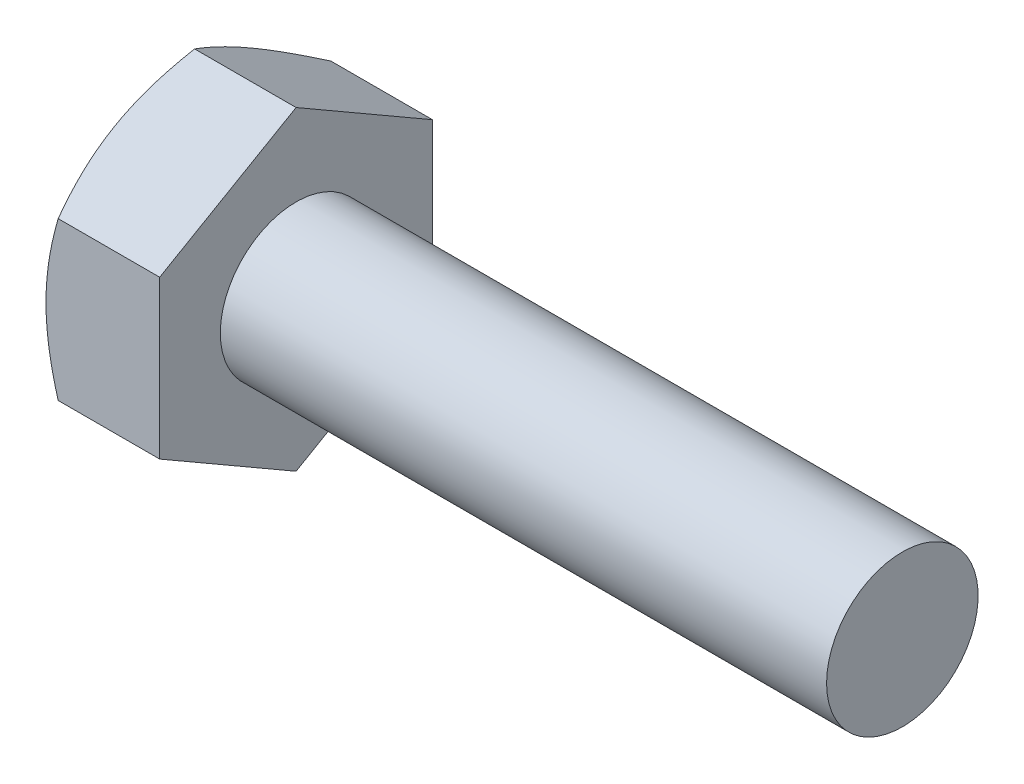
ISO-10303-21;
HEADER;
FILE_DESCRIPTION(('STEP AP214'),'2;1');
FILE_NAME('part.step','',(''),(''),'','','');
FILE_SCHEMA(('AUTOMOTIVE_DESIGN { 1 0 10303 214 1 1 1 1 }'));
ENDSEC;
DATA;
#1=APPLICATION_CONTEXT('core data for automotive mechanical design processes');
#2=APPLICATION_PROTOCOL_DEFINITION('international standard','automotive_design',2000,#1);
#3=PRODUCT_CONTEXT('',#1,'mechanical');
#4=PRODUCT('Part','Part','',(#3));
#5=PRODUCT_RELATED_PRODUCT_CATEGORY('part','',(#4));
#6=PRODUCT_DEFINITION_FORMATION('','',#4);
#7=PRODUCT_DEFINITION_CONTEXT('part definition',#1,'design');
#8=PRODUCT_DEFINITION('design','',#6,#7);
#9=PRODUCT_DEFINITION_SHAPE('','',#8);
#10=(LENGTH_UNIT() NAMED_UNIT(*) SI_UNIT(.MILLI.,.METRE.));
#11=(NAMED_UNIT(*) PLANE_ANGLE_UNIT() SI_UNIT($,.RADIAN.));
#12=(NAMED_UNIT(*) SI_UNIT($,.STERADIAN.) SOLID_ANGLE_UNIT());
#13=UNCERTAINTY_MEASURE_WITH_UNIT(LENGTH_MEASURE(1.E-05),#10,'distance_accuracy_value','');
#14=(GEOMETRIC_REPRESENTATION_CONTEXT(3) GLOBAL_UNCERTAINTY_ASSIGNED_CONTEXT((#13)) GLOBAL_UNIT_ASSIGNED_CONTEXT((#10,
#11,#12)) REPRESENTATION_CONTEXT('',''));
#15=CARTESIAN_POINT('',(0.,0.,0.));
#16=DIRECTION('',(0.,0.,1.));
#17=DIRECTION('',(1.,0.,0.));
#18=AXIS2_PLACEMENT_3D('',#15,#16,#17);
#19=CARTESIAN_POINT('',(0.,0.,0.));
#20=DIRECTION('',(-1.,0.,0.));
#21=DIRECTION('',(0.,0.,1.));
#22=AXIS2_PLACEMENT_3D('',#19,#20,#21);
#23=PLANE('',#22);
#24=CARTESIAN_POINT('',(0.,0.,0.));
#25=DIRECTION('',(-1.,0.,0.));
#26=DIRECTION('',(0.,0.,1.));
#27=AXIS2_PLACEMENT_3D('',#24,#25,#26);
#28=CIRCLE('',#27,9.);
#29=CARTESIAN_POINT('',(0.,0.,9.));
#30=VERTEX_POINT('',#29);
#31=CARTESIAN_POINT('',(0.,7.79422865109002,4.50000002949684));
#32=VERTEX_POINT('',#31);
#33=EDGE_CURVE('E40',#30,#32,#28,.T.);
#34=ORIENTED_EDGE('',*,*,#33,.T.);
#35=CARTESIAN_POINT('',(0.,7.79422865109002,-4.50000002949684));
#36=VERTEX_POINT('',#35);
#37=EDGE_CURVE('E200',#32,#36,#28,.T.);
#38=ORIENTED_EDGE('',*,*,#37,.T.);
#39=CARTESIAN_POINT('',(0.,0.,-9.));
#40=VERTEX_POINT('',#39);
#41=EDGE_CURVE('E205',#36,#40,#28,.T.);
#42=ORIENTED_EDGE('',*,*,#41,.T.);
#43=CARTESIAN_POINT('',(0.,-7.79422865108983,-4.50000002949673));
#44=VERTEX_POINT('',#43);
#45=EDGE_CURVE('E209',#40,#44,#28,.T.);
#46=ORIENTED_EDGE('',*,*,#45,.T.);
#47=CARTESIAN_POINT('',(0.,-7.79422865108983,4.50000002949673));
#48=VERTEX_POINT('',#47);
#49=EDGE_CURVE('E206',#44,#48,#28,.T.);
#50=ORIENTED_EDGE('',*,*,#49,.T.);
#51=EDGE_CURVE('E198',#48,#30,#28,.T.);
#52=ORIENTED_EDGE('',*,*,#51,.T.);
#53=EDGE_LOOP('',(#34,#38,#42,#46,#50,#52));
#54=FACE_BOUND('',#53,.T.);
#55=CARTESIAN_POINT('',(0.,0.,0.));
#56=DIRECTION('',(1.,0.,0.));
#57=DIRECTION('',(0.,0.,-1.));
#58=AXIS2_PLACEMENT_3D('',#55,#56,#57);
#59=CIRCLE('',#58,7.875);
#60=CARTESIAN_POINT('',(0.,0.,-7.875));
#61=VERTEX_POINT('',#60);
#62=EDGE_CURVE('E237',#61,#61,#59,.T.);
#63=ORIENTED_EDGE('',*,*,#62,.T.);
#64=EDGE_LOOP('',(#63));
#65=FACE_BOUND('',#64,.T.);
#66=ADVANCED_FACE('F32',(#54,#65),#23,.T.);
#67=CARTESIAN_POINT('',(7.5,5.,0.));
#68=DIRECTION('',(-1.,0.,0.));
#69=DIRECTION('',(0.,0.,1.));
#70=AXIS2_PLACEMENT_3D('',#67,#68,#69);
#71=PLANE('',#70);
#72=CARTESIAN_POINT('',(7.5,0.,0.));
#73=DIRECTION('',(-1.,0.,0.));
#74=DIRECTION('',(0.,0.,1.));
#75=AXIS2_PLACEMENT_3D('',#72,#73,#74);
#76=CIRCLE('',#75,5.);
#77=CARTESIAN_POINT('',(7.5,0.,5.));
#78=VERTEX_POINT('',#77);
#79=EDGE_CURVE('E196',#78,#78,#76,.T.);
#80=ORIENTED_EDGE('',*,*,#79,.T.);
#81=EDGE_LOOP('',(#80));
#82=FACE_BOUND('',#81,.T.);
#83=DIRECTION('',(0.,1.,0.));
#84=VECTOR('',#83,1.);
#85=CARTESIAN_POINT('',(7.5,-5.19615244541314,9.));
#86=LINE('',#85,#84);
#87=CARTESIAN_POINT('',(7.5,-5.19615244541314,9.));
#88=VERTEX_POINT('',#87);
#89=CARTESIAN_POINT('',(7.5,5.19615244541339,9.));
#90=VERTEX_POINT('',#89);
#91=EDGE_CURVE('E55',#88,#90,#86,.T.);
#92=ORIENTED_EDGE('',*,*,#91,.F.);
#93=DIRECTION('',(0.,0.50000000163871,0.866025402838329));
#94=VECTOR('',#93,1.);
#95=CARTESIAN_POINT('',(7.5,-10.3923048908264,0.));
#96=LINE('',#95,#94);
#97=CARTESIAN_POINT('',(7.5,-10.3923048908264,0.));
#98=VERTEX_POINT('',#97);
#99=EDGE_CURVE('E129',#98,#88,#96,.T.);
#100=ORIENTED_EDGE('',*,*,#99,.F.);
#101=DIRECTION('',(0.,-0.50000000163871,0.866025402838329));
#102=VECTOR('',#101,1.);
#103=CARTESIAN_POINT('',(7.5,-5.19615244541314,-9.));
#104=LINE('',#103,#102);
#105=CARTESIAN_POINT('',(7.5,-5.19615244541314,-9.));
#106=VERTEX_POINT('',#105);
#107=EDGE_CURVE('E127',#106,#98,#104,.T.);
#108=ORIENTED_EDGE('',*,*,#107,.F.);
#109=DIRECTION('',(0.,-1.,0.));
#110=VECTOR('',#109,1.);
#111=CARTESIAN_POINT('',(7.5,5.19615244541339,-9.));
#112=LINE('',#111,#110);
#113=CARTESIAN_POINT('',(7.5,5.19615244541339,-9.));
#114=VERTEX_POINT('',#113);
#115=EDGE_CURVE('E109',#114,#106,#112,.T.);
#116=ORIENTED_EDGE('',*,*,#115,.F.);
#117=DIRECTION('',(0.,-0.50000000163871,-0.866025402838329));
#118=VECTOR('',#117,1.);
#119=CARTESIAN_POINT('',(7.5,10.3923048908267,0.));
#120=LINE('',#119,#118);
#121=CARTESIAN_POINT('',(7.5,10.3923048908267,0.));
#122=VERTEX_POINT('',#121);
#123=EDGE_CURVE('E118',#122,#114,#120,.T.);
#124=ORIENTED_EDGE('',*,*,#123,.F.);
#125=DIRECTION('',(0.,0.50000000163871,-0.866025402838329));
#126=VECTOR('',#125,1.);
#127=CARTESIAN_POINT('',(7.5,5.19615244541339,9.));
#128=LINE('',#127,#126);
#129=EDGE_CURVE('E122',#90,#122,#128,.T.);
#130=ORIENTED_EDGE('',*,*,#129,.F.);
#131=EDGE_LOOP('',(#92,#100,#108,#116,#124,#130));
#132=FACE_BOUND('',#131,.T.);
#133=ADVANCED_FACE('F124',(#82,#132),#71,.F.);
#134=CARTESIAN_POINT('',(-25.4,0.,0.));
#135=DIRECTION('',(-1.,0.,0.));
#136=DIRECTION('',(0.,0.,1.));
#137=AXIS2_PLACEMENT_3D('',#134,#135,#136);
#138=CYLINDRICAL_SURFACE('',#137,5.);
#139=CARTESIAN_POINT('',(47.5,0.,0.));
#140=DIRECTION('',(-1.,0.,0.));
#141=DIRECTION('',(0.,0.,1.));
#142=AXIS2_PLACEMENT_3D('',#139,#140,#141);
#143=CIRCLE('',#142,5.);
#144=CARTESIAN_POINT('',(47.5,0.,5.));
#145=VERTEX_POINT('',#144);
#146=EDGE_CURVE('E11',#145,#145,#143,.T.);
#147=ORIENTED_EDGE('',*,*,#146,.T.);
#148=EDGE_LOOP('',(#147));
#149=FACE_BOUND('',#148,.T.);
#150=ORIENTED_EDGE('',*,*,#79,.F.);
#151=EDGE_LOOP('',(#150));
#152=FACE_BOUND('',#151,.T.);
#153=ADVANCED_FACE('F34',(#149,#152),#138,.T.);
#154=CARTESIAN_POINT('',(47.5,5.,0.));
#155=DIRECTION('',(1.,0.,0.));
#156=DIRECTION('',(0.,0.,-1.));
#157=AXIS2_PLACEMENT_3D('',#154,#155,#156);
#158=PLANE('',#157);
#159=ORIENTED_EDGE('',*,*,#146,.F.);
#160=EDGE_LOOP('',(#159));
#161=FACE_BOUND('',#160,.T.);
#162=ADVANCED_FACE('F177',(#161),#158,.T.);
#163=CARTESIAN_POINT('',(7.5,-5.19615244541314,9.));
#164=DIRECTION('',(0.,0.,1.));
#165=DIRECTION('',(0.,-1.,0.));
#166=AXIS2_PLACEMENT_3D('',#163,#164,#165);
#167=PLANE('',#166);
#168=DIRECTION('',(-1.,0.,0.));
#169=VECTOR('',#168,1.);
#170=CARTESIAN_POINT('',(7.5,-5.19615244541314,9.));
#171=LINE('',#170,#169);
#172=CARTESIAN_POINT('',(0.803847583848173,-5.19615244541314,9.));
#173=VERTEX_POINT('',#172);
#174=EDGE_CURVE('E136',#88,#173,#171,.T.);
#175=ORIENTED_EDGE('',*,*,#174,.F.);
#176=ORIENTED_EDGE('',*,*,#91,.T.);
#177=DIRECTION('',(-1.,0.,0.));
#178=VECTOR('',#177,1.);
#179=CARTESIAN_POINT('',(7.5,5.19615244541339,9.));
#180=LINE('',#179,#178);
#181=CARTESIAN_POINT('',(0.803847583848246,5.19615244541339,9.));
#182=VERTEX_POINT('',#181);
#183=EDGE_CURVE('E135',#90,#182,#180,.T.);
#184=ORIENTED_EDGE('',*,*,#183,.T.);
#185=CARTESIAN_POINT('',(4.30675215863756,-13.7809864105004,9.00000000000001));
#186=CARTESIAN_POINT('',(4.21125056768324,-13.5834182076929,9.00000000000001));
#187=CARTESIAN_POINT('',(4.11624323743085,-13.3856112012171,9.00000000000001));
#188=CARTESIAN_POINT('',(3.92733055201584,-12.9894691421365,9.00000000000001));
#189=CARTESIAN_POINT('',(3.83342520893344,-12.7911340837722,9.00000000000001));
#190=CARTESIAN_POINT('',(3.55350512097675,-12.1952030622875,9.00000000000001));
#191=CARTESIAN_POINT('',(3.36931745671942,-11.7967454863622,9.00000000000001));
#192=CARTESIAN_POINT('',(3.00594950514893,-10.9947966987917,9.00000000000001));
#193=CARTESIAN_POINT('',(2.82680390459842,-10.5912897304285,9.));
#194=CARTESIAN_POINT('',(2.47620436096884,-9.78096004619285,9.));
#195=CARTESIAN_POINT('',(2.30475001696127,-9.37413750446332,9.));
#196=CARTESIAN_POINT('',(1.96954751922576,-8.55147796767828,9.));
#197=CARTESIAN_POINT('',(1.80591981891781,-8.13559162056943,9.));
#198=CARTESIAN_POINT('',(1.49147930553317,-7.2989146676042,9.));
#199=CARTESIAN_POINT('',(1.34066791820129,-6.87812352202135,9.));
#200=CARTESIAN_POINT('',(1.05591315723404,-6.03182651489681,9.));
#201=CARTESIAN_POINT('',(0.921933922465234,-5.6063328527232,9.));
#202=CARTESIAN_POINT('',(0.675192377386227,-4.74931186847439,9.));
#203=CARTESIAN_POINT('',(0.562423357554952,-4.31778650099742,9.));
#204=CARTESIAN_POINT('',(0.363585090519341,-3.44833526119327,9.));
#205=CARTESIAN_POINT('',(0.27752295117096,-3.0104077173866,9.));
#206=CARTESIAN_POINT('',(0.172769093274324,-2.34966278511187,9.));
#207=CARTESIAN_POINT('',(0.141905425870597,-2.12874509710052,9.));
#208=CARTESIAN_POINT('',(0.0888984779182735,-1.68587395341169,9.));
#209=CARTESIAN_POINT('',(0.0667543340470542,-1.46392060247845,9.));
#210=CARTESIAN_POINT('',(0.0317823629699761,-1.02068615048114,9.));
#211=CARTESIAN_POINT('',(0.0188966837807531,-0.799409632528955,9.));
#212=CARTESIAN_POINT('',(0.00250976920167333,-0.356509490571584,9.));
#213=CARTESIAN_POINT('',(-0.000991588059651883,-0.1348858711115,9.));
#214=CARTESIAN_POINT('',(0.00147357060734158,0.308247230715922,9.));
#215=CARTESIAN_POINT('',(0.00743742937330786,0.529756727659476,9.));
#216=CARTESIAN_POINT('',(0.0286847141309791,0.972331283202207,9.));
#217=CARTESIAN_POINT('',(0.0439686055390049,1.19339631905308,9.));
#218=CARTESIAN_POINT('',(0.0919878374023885,1.72918911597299,9.));
#219=CARTESIAN_POINT('',(0.129392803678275,2.0435052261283,9.));
#220=CARTESIAN_POINT('',(0.220967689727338,2.66972888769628,9.));
#221=CARTESIAN_POINT('',(0.275142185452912,2.98163575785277,9.));
#222=CARTESIAN_POINT('',(0.398334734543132,3.60278361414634,9.));
#223=CARTESIAN_POINT('',(0.46736682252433,3.91202179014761,9.));
#224=CARTESIAN_POINT('',(0.61816830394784,4.52731652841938,9.));
#225=CARTESIAN_POINT('',(0.69993649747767,4.83337338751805,9.));
#226=CARTESIAN_POINT('',(0.876391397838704,5.44984363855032,9.));
#227=CARTESIAN_POINT('',(0.971345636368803,5.76017992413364,9.));
#228=CARTESIAN_POINT('',(1.17063619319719,6.37757223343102,9.));
#229=CARTESIAN_POINT('',(1.27496604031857,6.68463035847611,9.));
#230=CARTESIAN_POINT('',(1.49085277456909,7.29423423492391,9.));
#231=CARTESIAN_POINT('',(1.60236567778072,7.59679565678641,9.));
#232=CARTESIAN_POINT('',(1.8319366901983,8.1995710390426,9.));
#233=CARTESIAN_POINT('',(1.9499974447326,8.49978399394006,9.));
#234=CARTESIAN_POINT('',(2.07068439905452,8.79890630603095,9.));
#235=B_SPLINE_CURVE_WITH_KNOTS('',3,(#185,#186,#187,#188,#189,#190,#191,#192,#193,#194,#195,
#196,#197,#198,#199,#200,#201,#202,#203,#204,#205,#206,#207,#208,#209,#210,#211,#212,#213,#214,
#215,#216,#217,#218,#219,#220,#221,#222,#223,#224,#225,#226,#227,#228,#229,#230,#231,#232,#233,
#234),.UNSPECIFIED.,.F.,.F.,(4,2,2,2,2,2,2,2,2,2,2,2,2,2,2,2,2,2,2,2,2,2,2,2,4),(0.,
0.658317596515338,1.31664240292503,2.63350615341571,3.95790574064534,5.28223620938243,
6.62282571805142,7.96356416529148,9.3013958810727,10.6388036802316,11.9765671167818,
12.6456116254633,13.3145898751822,13.9793507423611,14.6441029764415,15.3086686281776,
15.9732674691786,16.9223404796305,17.8716726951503,18.8219056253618,19.772049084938,
20.7454827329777,21.7182495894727,22.6855410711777,23.6532262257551),.UNSPECIFIED.);
#236=EDGE_CURVE('E179',#30,#182,#235,.T.);
#237=ORIENTED_EDGE('',*,*,#236,.F.);
#238=EDGE_CURVE('E187',#173,#30,#235,.T.);
#239=ORIENTED_EDGE('',*,*,#238,.F.);
#240=EDGE_LOOP('',(#175,#176,#184,#237,#239));
#241=FACE_BOUND('',#240,.T.);
#242=ADVANCED_FACE('F173',(#241),#167,.T.);
#243=CARTESIAN_POINT('',(7.5,-10.3923048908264,0.));
#244=DIRECTION('',(0.,-0.866025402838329,0.50000000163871));
#245=DIRECTION('',(0.,-0.50000000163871,-0.866025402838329));
#246=AXIS2_PLACEMENT_3D('',#243,#244,#245);
#247=PLANE('',#246);
#248=DIRECTION('',(-1.,0.,0.));
#249=VECTOR('',#248,1.);
#250=CARTESIAN_POINT('',(7.5,-10.3923048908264,0.));
#251=LINE('',#250,#249);
#252=CARTESIAN_POINT('',(0.803847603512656,-10.3923048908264,0.));
#253=VERTEX_POINT('',#252);
#254=EDGE_CURVE('E140',#98,#253,#251,.T.);
#255=ORIENTED_EDGE('',*,*,#254,.F.);
#256=ORIENTED_EDGE('',*,*,#99,.T.);
#257=ORIENTED_EDGE('',*,*,#174,.T.);
#258=CARTESIAN_POINT('',(0.803914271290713,-10.3924203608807,-0.000200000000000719));
#259=CARTESIAN_POINT('',(0.737982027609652,-10.2782164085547,0.197607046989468));
#260=CARTESIAN_POINT('',(0.675041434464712,-10.1635670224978,0.396185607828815));
#261=CARTESIAN_POINT('',(0.555969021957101,-9.93333719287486,0.794955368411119));
#262=CARTESIAN_POINT('',(0.499840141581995,-9.81775637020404,0.995147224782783));
#263=CARTESIAN_POINT('',(0.395151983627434,-9.58544919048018,1.39751506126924));
#264=CARTESIAN_POINT('',(0.346610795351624,-9.46872078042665,1.59969459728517));
#265=CARTESIAN_POINT('',(0.258148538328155,-9.23447005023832,2.00542876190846));
#266=CARTESIAN_POINT('',(0.218225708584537,-9.11694789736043,2.20898310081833));
#267=CARTESIAN_POINT('',(0.148684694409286,-8.88408936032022,2.61230591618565));
#268=CARTESIAN_POINT('',(0.118837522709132,-8.76877017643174,2.81204460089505));
#269=CARTESIAN_POINT('',(0.0687933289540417,-8.53761582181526,3.21241568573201));
#270=CARTESIAN_POINT('',(0.04859545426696,-8.42178069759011,3.41304800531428));
#271=CARTESIAN_POINT('',(0.0183543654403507,-8.18990952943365,3.8146606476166));
#272=CARTESIAN_POINT('',(0.00829962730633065,-8.07387386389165,4.01564031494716));
#273=CARTESIAN_POINT('',(-0.0014376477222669,-7.84169574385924,4.41778461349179));
#274=CARTESIAN_POINT('',(-0.0011205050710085,-7.725553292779,4.61894923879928));
#275=CARTESIAN_POINT('',(0.00916396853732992,-7.50842144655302,4.99503262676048));
#276=CARTESIAN_POINT('',(0.0178767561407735,-7.40741674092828,5.16997790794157));
#277=CARTESIAN_POINT('',(0.0429773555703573,-7.2056439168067,5.5194586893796));
#278=CARTESIAN_POINT('',(0.0593656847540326,-7.10487581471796,5.69399416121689));
#279=CARTESIAN_POINT('',(0.119656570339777,-6.80296161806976,6.21692488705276));
#280=CARTESIAN_POINT('',(0.17467749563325,-6.60234992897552,6.56439452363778));
#281=CARTESIAN_POINT('',(0.312230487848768,-6.19899853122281,7.26301963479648));
#282=CARTESIAN_POINT('',(0.39534562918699,-5.99631029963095,7.61408594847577));
#283=CARTESIAN_POINT('',(0.583982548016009,-5.59395642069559,8.31098330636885));
#284=CARTESIAN_POINT('',(0.689460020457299,-5.39428562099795,8.65682327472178));
#285=CARTESIAN_POINT('',(0.803914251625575,-5.19603697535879,9.0002));
#286=B_SPLINE_CURVE_WITH_KNOTS('',3,(#258,#259,#260,#261,#262,#263,#264,#265,#266,#267,#268,
#269,#270,#271,#272,#273,#274,#275,#276,#277,#278,#279,#280,#281,#282,#283,#284,#285),
.UNSPECIFIED.,.F.,.F.,(4,2,2,2,2,2,2,2,2,2,2,2,2,4),(0.,0.713219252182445,1.42674514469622,
2.14194698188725,2.8570025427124,3.55449750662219,4.25193082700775,4.94857087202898,
5.6451893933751,6.25162978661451,6.85811106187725,8.07193749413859,9.3126839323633,
10.5509947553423),.UNSPECIFIED.);
#287=EDGE_CURVE('E189',#48,#173,#286,.T.);
#288=ORIENTED_EDGE('',*,*,#287,.F.);
#289=EDGE_CURVE('E188',#253,#48,#286,.T.);
#290=ORIENTED_EDGE('',*,*,#289,.F.);
#291=EDGE_LOOP('',(#255,#256,#257,#288,#290));
#292=FACE_BOUND('',#291,.T.);
#293=ADVANCED_FACE('F176',(#292),#247,.T.);
#294=CARTESIAN_POINT('',(7.5,-5.19615244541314,-9.));
#295=DIRECTION('',(0.,-0.866025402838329,-0.50000000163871));
#296=DIRECTION('',(0.,0.50000000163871,-0.866025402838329));
#297=AXIS2_PLACEMENT_3D('',#294,#295,#296);
#298=PLANE('',#297);
#299=DIRECTION('',(-1.,0.,0.));
#300=VECTOR('',#299,1.);
#301=CARTESIAN_POINT('',(7.5,-5.19615244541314,-9.));
#302=LINE('',#301,#300);
#303=CARTESIAN_POINT('',(0.803847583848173,-5.19615244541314,-9.));
#304=VERTEX_POINT('',#303);
#305=EDGE_CURVE('E115',#106,#304,#302,.T.);
#306=ORIENTED_EDGE('',*,*,#305,.F.);
#307=ORIENTED_EDGE('',*,*,#107,.T.);
#308=ORIENTED_EDGE('',*,*,#254,.T.);
#309=CARTESIAN_POINT('',(0.803914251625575,-5.19603697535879,-9.0002));
#310=CARTESIAN_POINT('',(0.737982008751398,-5.31024092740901,-8.80239295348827));
#311=CARTESIAN_POINT('',(0.675041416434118,-5.42489031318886,-8.60381439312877));
#312=CARTESIAN_POINT('',(0.555969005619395,-5.65512014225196,-8.20504463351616));
#313=CARTESIAN_POINT('',(0.499840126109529,-5.77070096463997,-8.00485277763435));
#314=CARTESIAN_POINT('',(0.395151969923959,-6.00300814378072,-7.60248494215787));
#315=CARTESIAN_POINT('',(0.346610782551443,-6.11973655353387,-7.40030540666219));
#316=CARTESIAN_POINT('',(0.258148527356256,-6.35398728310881,-6.99457124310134));
#317=CARTESIAN_POINT('',(0.218225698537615,-6.47150943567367,-6.79101690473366));
#318=CARTESIAN_POINT('',(0.148684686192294,-6.70436797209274,-6.38769409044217));
#319=CARTESIAN_POINT('',(0.118837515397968,-6.81968715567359,-6.18795540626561));
#320=CARTESIAN_POINT('',(0.0687933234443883,-7.05084150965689,-5.78758432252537));
#321=CARTESIAN_POINT('',(0.0485954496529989,-7.16667663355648,-5.58695200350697));
#322=CARTESIAN_POINT('',(0.0183543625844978,-7.39854780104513,-5.18533936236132));
#323=CARTESIAN_POINT('',(0.00829962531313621,-7.51458346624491,-4.98435969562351));
#324=CARTESIAN_POINT('',(-0.0014376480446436,-7.74676158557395,-4.58221539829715));
#325=CARTESIAN_POINT('',(-0.00112050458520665,-7.86290403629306,-4.38105077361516));
#326=CARTESIAN_POINT('',(0.00916397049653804,-8.08003588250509,-4.00496738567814));
#327=CARTESIAN_POINT('',(0.0178767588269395,-8.18104058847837,-3.83002210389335));
#328=CARTESIAN_POINT('',(0.0429773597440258,-8.38281341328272,-3.48054132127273));
#329=CARTESIAN_POINT('',(0.0593656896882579,-8.48358151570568,-3.30600584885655));
#330=CARTESIAN_POINT('',(0.119656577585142,-8.78549571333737,-2.78307512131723));
#331=CARTESIAN_POINT('',(0.174677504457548,-8.98610740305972,-2.43560548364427));
#332=CARTESIAN_POINT('',(0.312230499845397,-9.3894588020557,-1.73698037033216));
#333=CARTESIAN_POINT('',(0.395345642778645,-9.59214703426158,-1.38591405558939));
#334=CARTESIAN_POINT('',(0.583982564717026,-9.99450091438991,-0.689016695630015));
#335=CARTESIAN_POINT('',(0.689460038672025,-10.1941717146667,-0.343176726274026));
#336=CARTESIAN_POINT('',(0.803914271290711,-10.3924203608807,0.000199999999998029));
#337=B_SPLINE_CURVE_WITH_KNOTS('',3,(#309,#310,#311,#312,#313,#314,#315,#316,#317,#318,#319,
#320,#321,#322,#323,#324,#325,#326,#327,#328,#329,#330,#331,#332,#333,#334,#335,#336),
.UNSPECIFIED.,.F.,.F.,(4,2,2,2,2,2,2,2,2,2,2,2,2,4),(0.,0.713219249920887,1.42674514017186,
2.14194697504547,2.85700253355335,3.55449749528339,4.25193081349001,4.94857085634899,
5.64518937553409,6.25162977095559,6.85811104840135,8.07193748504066,9.31268392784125,
10.5509947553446),.UNSPECIFIED.);
#338=EDGE_CURVE('E219',#44,#253,#337,.T.);
#339=ORIENTED_EDGE('',*,*,#338,.F.);
#340=EDGE_CURVE('E224',#304,#44,#337,.T.);
#341=ORIENTED_EDGE('',*,*,#340,.F.);
#342=EDGE_LOOP('',(#306,#307,#308,#339,#341));
#343=FACE_BOUND('',#342,.T.);
#344=ADVANCED_FACE('F296',(#343),#298,.T.);
#345=CARTESIAN_POINT('',(7.5,5.19615244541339,-9.));
#346=DIRECTION('',(0.,0.,-1.));
#347=DIRECTION('',(0.,1.,0.));
#348=AXIS2_PLACEMENT_3D('',#345,#346,#347);
#349=PLANE('',#348);
#350=DIRECTION('',(-1.,0.,0.));
#351=VECTOR('',#350,1.);
#352=CARTESIAN_POINT('',(7.5,5.19615244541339,-9.));
#353=LINE('',#352,#351);
#354=CARTESIAN_POINT('',(0.803847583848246,5.19615244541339,-9.));
#355=VERTEX_POINT('',#354);
#356=EDGE_CURVE('E104',#114,#355,#353,.T.);
#357=ORIENTED_EDGE('',*,*,#356,.F.);
#358=ORIENTED_EDGE('',*,*,#115,.T.);
#359=ORIENTED_EDGE('',*,*,#305,.T.);
#360=CARTESIAN_POINT('',(4.30675215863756,-13.7809864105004,-9.00000000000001));
#361=CARTESIAN_POINT('',(4.21125056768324,-13.5834182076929,-9.00000000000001));
#362=CARTESIAN_POINT('',(4.11624323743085,-13.3856112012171,-9.00000000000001));
#363=CARTESIAN_POINT('',(3.92733055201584,-12.9894691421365,-9.00000000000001));
#364=CARTESIAN_POINT('',(3.83342520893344,-12.7911340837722,-9.00000000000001));
#365=CARTESIAN_POINT('',(3.55350512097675,-12.1952030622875,-9.00000000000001));
#366=CARTESIAN_POINT('',(3.36931745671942,-11.7967454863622,-9.00000000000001));
#367=CARTESIAN_POINT('',(3.00594950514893,-10.9947966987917,-9.00000000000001));
#368=CARTESIAN_POINT('',(2.82680390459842,-10.5912897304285,-9.));
#369=CARTESIAN_POINT('',(2.47620436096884,-9.78096004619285,-9.));
#370=CARTESIAN_POINT('',(2.30475001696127,-9.37413750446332,-9.));
#371=CARTESIAN_POINT('',(1.96954751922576,-8.55147796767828,-9.));
#372=CARTESIAN_POINT('',(1.80591981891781,-8.13559162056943,-9.));
#373=CARTESIAN_POINT('',(1.49147930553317,-7.2989146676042,-9.));
#374=CARTESIAN_POINT('',(1.34066791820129,-6.87812352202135,-9.));
#375=CARTESIAN_POINT('',(1.05591315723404,-6.03182651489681,-9.));
#376=CARTESIAN_POINT('',(0.921933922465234,-5.6063328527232,-9.));
#377=CARTESIAN_POINT('',(0.675192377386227,-4.74931186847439,-9.));
#378=CARTESIAN_POINT('',(0.562423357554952,-4.31778650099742,-9.));
#379=CARTESIAN_POINT('',(0.363585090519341,-3.44833526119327,-9.));
#380=CARTESIAN_POINT('',(0.27752295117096,-3.0104077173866,-9.));
#381=CARTESIAN_POINT('',(0.172769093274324,-2.34966278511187,-9.));
#382=CARTESIAN_POINT('',(0.141905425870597,-2.12874509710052,-9.));
#383=CARTESIAN_POINT('',(0.0888984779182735,-1.68587395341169,-9.));
#384=CARTESIAN_POINT('',(0.0667543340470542,-1.46392060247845,-9.));
#385=CARTESIAN_POINT('',(0.0317823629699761,-1.02068615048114,-9.));
#386=CARTESIAN_POINT('',(0.0188966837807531,-0.799409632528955,-9.));
#387=CARTESIAN_POINT('',(0.00250976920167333,-0.356509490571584,-9.));
#388=CARTESIAN_POINT('',(-0.000991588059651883,-0.1348858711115,-9.));
#389=CARTESIAN_POINT('',(0.00147357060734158,0.308247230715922,-9.));
#390=CARTESIAN_POINT('',(0.00743742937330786,0.529756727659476,-9.));
#391=CARTESIAN_POINT('',(0.0286847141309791,0.972331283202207,-9.));
#392=CARTESIAN_POINT('',(0.0439686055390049,1.19339631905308,-9.));
#393=CARTESIAN_POINT('',(0.0919878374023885,1.72918911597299,-9.));
#394=CARTESIAN_POINT('',(0.129392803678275,2.0435052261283,-9.));
#395=CARTESIAN_POINT('',(0.220967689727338,2.66972888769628,-9.));
#396=CARTESIAN_POINT('',(0.275142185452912,2.98163575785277,-9.));
#397=CARTESIAN_POINT('',(0.398334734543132,3.60278361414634,-9.));
#398=CARTESIAN_POINT('',(0.46736682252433,3.91202179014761,-9.));
#399=CARTESIAN_POINT('',(0.61816830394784,4.52731652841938,-9.));
#400=CARTESIAN_POINT('',(0.69993649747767,4.83337338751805,-9.));
#401=CARTESIAN_POINT('',(0.876391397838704,5.44984363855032,-9.));
#402=CARTESIAN_POINT('',(0.971345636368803,5.76017992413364,-9.));
#403=CARTESIAN_POINT('',(1.17063619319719,6.37757223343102,-9.));
#404=CARTESIAN_POINT('',(1.27496604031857,6.68463035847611,-9.));
#405=CARTESIAN_POINT('',(1.49085277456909,7.29423423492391,-9.));
#406=CARTESIAN_POINT('',(1.60236567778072,7.59679565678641,-9.));
#407=CARTESIAN_POINT('',(1.8319366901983,8.1995710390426,-9.));
#408=CARTESIAN_POINT('',(1.9499974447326,8.49978399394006,-9.));
#409=CARTESIAN_POINT('',(2.07068439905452,8.79890630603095,-9.));
#410=B_SPLINE_CURVE_WITH_KNOTS('',3,(#360,#361,#362,#363,#364,#365,#366,#367,#368,#369,#370,
#371,#372,#373,#374,#375,#376,#377,#378,#379,#380,#381,#382,#383,#384,#385,#386,#387,#388,#389,
#390,#391,#392,#393,#394,#395,#396,#397,#398,#399,#400,#401,#402,#403,#404,#405,#406,#407,#408,
#409),.UNSPECIFIED.,.F.,.F.,(4,2,2,2,2,2,2,2,2,2,2,2,2,2,2,2,2,2,2,2,2,2,2,2,4),(0.,
0.658317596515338,1.31664240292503,2.63350615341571,3.95790574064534,5.28223620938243,
6.62282571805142,7.96356416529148,9.3013958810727,10.6388036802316,11.9765671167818,
12.6456116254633,13.3145898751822,13.9793507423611,14.6441029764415,15.3086686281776,
15.9732674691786,16.9223404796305,17.8716726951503,18.8219056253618,19.772049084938,
20.7454827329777,21.7182495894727,22.6855410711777,23.6532262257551),.UNSPECIFIED.);
#411=EDGE_CURVE('E220',#40,#304,#410,.F.);
#412=ORIENTED_EDGE('',*,*,#411,.F.);
#413=EDGE_CURVE('E112',#355,#40,#410,.F.);
#414=ORIENTED_EDGE('',*,*,#413,.F.);
#415=EDGE_LOOP('',(#357,#358,#359,#412,#414));
#416=FACE_BOUND('',#415,.T.);
#417=ADVANCED_FACE('F106',(#416),#349,.T.);
#418=CARTESIAN_POINT('',(7.5,10.3923048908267,0.));
#419=DIRECTION('',(0.,0.866025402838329,-0.50000000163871));
#420=DIRECTION('',(0.,0.50000000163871,0.866025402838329));
#421=AXIS2_PLACEMENT_3D('',#418,#419,#420);
#422=PLANE('',#421);
#423=DIRECTION('',(-1.,0.,0.));
#424=VECTOR('',#423,1.);
#425=CARTESIAN_POINT('',(7.5,10.3923048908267,0.));
#426=LINE('',#425,#424);
#427=CARTESIAN_POINT('',(0.803847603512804,10.3923048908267,0.));
#428=VERTEX_POINT('',#427);
#429=EDGE_CURVE('E47',#122,#428,#426,.T.);
#430=ORIENTED_EDGE('',*,*,#429,.F.);
#431=ORIENTED_EDGE('',*,*,#123,.T.);
#432=ORIENTED_EDGE('',*,*,#356,.T.);
#433=CARTESIAN_POINT('',(0.803914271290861,10.392420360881,0.000199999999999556));
#434=CARTESIAN_POINT('',(0.737982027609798,10.278216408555,-0.197607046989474));
#435=CARTESIAN_POINT('',(0.675041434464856,10.1635670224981,-0.396185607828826));
#436=CARTESIAN_POINT('',(0.555969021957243,9.93333719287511,-0.794955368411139));
#437=CARTESIAN_POINT('',(0.499840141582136,9.81775637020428,-0.995147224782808));
#438=CARTESIAN_POINT('',(0.395151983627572,9.58544919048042,-1.39751506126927));
#439=CARTESIAN_POINT('',(0.34661079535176,9.46872078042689,-1.59969459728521));
#440=CARTESIAN_POINT('',(0.258148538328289,9.23447005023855,-2.00542876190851));
#441=CARTESIAN_POINT('',(0.218225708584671,9.11694789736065,-2.20898310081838));
#442=CARTESIAN_POINT('',(0.148684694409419,8.88408936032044,-2.61230591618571));
#443=CARTESIAN_POINT('',(0.118837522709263,8.76877017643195,-2.81204460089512));
#444=CARTESIAN_POINT('',(0.0687933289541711,8.53761582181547,-3.21241568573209));
#445=CARTESIAN_POINT('',(0.048595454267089,8.42178069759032,-3.41304800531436));
#446=CARTESIAN_POINT('',(0.0183543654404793,8.18990952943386,-3.8146606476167));
#447=CARTESIAN_POINT('',(0.00829962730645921,8.07387386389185,-4.01564031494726));
#448=CARTESIAN_POINT('',(-0.00143764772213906,7.84169574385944,-4.4177846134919));
#449=CARTESIAN_POINT('',(-0.00112050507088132,7.72555329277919,-4.6189492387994));
#450=CARTESIAN_POINT('',(0.00916396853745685,7.5084214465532,-4.99503262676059));
#451=CARTESIAN_POINT('',(0.0178767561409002,7.40741674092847,-5.16997790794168));
#452=CARTESIAN_POINT('',(0.042977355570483,7.2056439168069,-5.5194586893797));
#453=CARTESIAN_POINT('',(0.0593656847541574,7.10487581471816,-5.69399416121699));
#454=CARTESIAN_POINT('',(0.119656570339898,6.80296161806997,-6.21692488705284));
#455=CARTESIAN_POINT('',(0.174677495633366,6.60234992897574,-6.56439452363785));
#456=CARTESIAN_POINT('',(0.312230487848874,6.19899853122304,-7.26301963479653));
#457=CARTESIAN_POINT('',(0.395345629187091,5.99631029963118,-7.6140859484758));
#458=CARTESIAN_POINT('',(0.583982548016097,5.59395642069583,-8.31098330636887));
#459=CARTESIAN_POINT('',(0.68946002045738,5.3942856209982,-8.65682327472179));
#460=CARTESIAN_POINT('',(0.803914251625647,5.19603697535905,-9.0002));
#461=B_SPLINE_CURVE_WITH_KNOTS('',3,(#433,#434,#435,#436,#437,#438,#439,#440,#441,#442,#443,
#444,#445,#446,#447,#448,#449,#450,#451,#452,#453,#454,#455,#456,#457,#458,#459,#460),
.UNSPECIFIED.,.F.,.F.,(4,2,2,2,2,2,2,2,2,2,2,2,2,4),(0.,0.713219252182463,1.42674514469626,
2.14194698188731,2.85700254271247,3.55449750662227,4.25193082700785,4.94857087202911,
5.64518939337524,6.25162978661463,6.85811106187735,8.07193749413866,9.31268393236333,
10.5509947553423),.UNSPECIFIED.);
#462=EDGE_CURVE('E155',#36,#355,#461,.T.);
#463=ORIENTED_EDGE('',*,*,#462,.F.);
#464=EDGE_CURVE('E383',#428,#36,#461,.T.);
#465=ORIENTED_EDGE('',*,*,#464,.F.);
#466=EDGE_LOOP('',(#430,#431,#432,#463,#465));
#467=FACE_BOUND('',#466,.T.);
#468=ADVANCED_FACE('F119',(#467),#422,.T.);
#469=CARTESIAN_POINT('',(7.5,5.19615244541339,9.));
#470=DIRECTION('',(0.,0.866025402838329,0.50000000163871));
#471=DIRECTION('',(0.,-0.50000000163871,0.866025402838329));
#472=AXIS2_PLACEMENT_3D('',#469,#470,#471);
#473=PLANE('',#472);
#474=ORIENTED_EDGE('',*,*,#183,.F.);
#475=ORIENTED_EDGE('',*,*,#129,.T.);
#476=ORIENTED_EDGE('',*,*,#429,.T.);
#477=CARTESIAN_POINT('',(0.803914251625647,5.19603697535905,9.0002));
#478=CARTESIAN_POINT('',(0.737982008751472,5.31024092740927,8.80239295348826));
#479=CARTESIAN_POINT('',(0.675041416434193,5.42489031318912,8.60381439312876));
#480=CARTESIAN_POINT('',(0.555969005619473,5.65512014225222,8.20504463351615));
#481=CARTESIAN_POINT('',(0.49984012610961,5.77070096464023,8.00485277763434));
#482=CARTESIAN_POINT('',(0.395151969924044,6.00300814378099,7.60248494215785));
#483=CARTESIAN_POINT('',(0.346610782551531,6.11973655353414,7.40030540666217));
#484=CARTESIAN_POINT('',(0.258148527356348,6.35398728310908,6.99457124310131));
#485=CARTESIAN_POINT('',(0.218225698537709,6.47150943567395,6.79101690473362));
#486=CARTESIAN_POINT('',(0.148684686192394,6.70436797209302,6.38769409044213));
#487=CARTESIAN_POINT('',(0.118837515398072,6.81968715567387,6.18795540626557));
#488=CARTESIAN_POINT('',(0.0687933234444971,7.05084150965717,5.78758432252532));
#489=CARTESIAN_POINT('',(0.0485954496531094,7.16667663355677,5.58695200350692));
#490=CARTESIAN_POINT('',(0.0183543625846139,7.39854780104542,5.18533936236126));
#491=CARTESIAN_POINT('',(0.00829962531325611,7.5145834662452,4.98435969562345));
#492=CARTESIAN_POINT('',(-0.00143764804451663,7.74676158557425,4.58221539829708));
#493=CARTESIAN_POINT('',(-0.0011205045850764,7.86290403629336,4.38105077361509));
#494=CARTESIAN_POINT('',(0.00916397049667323,8.08003588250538,4.00496738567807));
#495=CARTESIAN_POINT('',(0.0178767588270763,8.18104058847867,3.83002210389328));
#496=CARTESIAN_POINT('',(0.0429773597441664,8.382813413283,3.48054132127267));
#497=CARTESIAN_POINT('',(0.0593656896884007,8.48358151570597,3.30600584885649));
#498=CARTESIAN_POINT('',(0.119656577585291,8.78549571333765,2.78307512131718));
#499=CARTESIAN_POINT('',(0.174677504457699,8.98610740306,2.43560548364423));
#500=CARTESIAN_POINT('',(0.312230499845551,9.38945880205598,1.73698037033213));
#501=CARTESIAN_POINT('',(0.395345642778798,9.59214703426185,1.38591405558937));
#502=CARTESIAN_POINT('',(0.583982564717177,9.99450091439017,0.68901669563));
#503=CARTESIAN_POINT('',(0.689460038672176,10.1941717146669,0.343176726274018));
#504=CARTESIAN_POINT('',(0.803914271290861,10.392420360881,-0.000199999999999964));
#505=B_SPLINE_CURVE_WITH_KNOTS('',3,(#477,#478,#479,#480,#481,#482,#483,#484,#485,#486,#487,
#488,#489,#490,#491,#492,#493,#494,#495,#496,#497,#498,#499,#500,#501,#502,#503,#504),
.UNSPECIFIED.,.F.,.F.,(4,2,2,2,2,2,2,2,2,2,2,2,2,4),(0.,0.713219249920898,1.42674514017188,
2.1419469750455,2.85700253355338,3.55449749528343,4.25193081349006,4.94857085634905,
5.64518937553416,6.25162977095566,6.8581110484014,8.07193748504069,9.31268392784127,
10.5509947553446),.UNSPECIFIED.);
#506=EDGE_CURVE('E139',#32,#428,#505,.T.);
#507=ORIENTED_EDGE('',*,*,#506,.F.);
#508=EDGE_CURVE('E154',#182,#32,#505,.T.);
#509=ORIENTED_EDGE('',*,*,#508,.F.);
#510=EDGE_LOOP('',(#474,#475,#476,#507,#509));
#511=FACE_BOUND('',#510,.T.);
#512=ADVANCED_FACE('F166',(#511),#473,.T.);
#513=CARTESIAN_POINT('',(0.,0.,0.));
#514=DIRECTION('',(1.,0.,0.));
#515=DIRECTION('',(0.,0.,-1.));
#516=AXIS2_PLACEMENT_3D('',#513,#514,#515);
#517=CONICAL_SURFACE('',#516,9.,1.0471975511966);
#518=ORIENTED_EDGE('',*,*,#51,.F.);
#519=ORIENTED_EDGE('',*,*,#287,.T.);
#520=ORIENTED_EDGE('',*,*,#238,.T.);
#521=EDGE_LOOP('',(#518,#519,#520));
#522=FACE_BOUND('',#521,.T.);
#523=ADVANCED_FACE('F170',(#522),#517,.T.);
#524=ORIENTED_EDGE('',*,*,#49,.F.);
#525=ORIENTED_EDGE('',*,*,#338,.T.);
#526=ORIENTED_EDGE('',*,*,#289,.T.);
#527=EDGE_LOOP('',(#524,#525,#526));
#528=FACE_BOUND('',#527,.T.);
#529=ADVANCED_FACE('F229',(#528),#517,.T.);
#530=ORIENTED_EDGE('',*,*,#411,.T.);
#531=ORIENTED_EDGE('',*,*,#340,.T.);
#532=ORIENTED_EDGE('',*,*,#45,.F.);
#533=EDGE_LOOP('',(#530,#531,#532));
#534=FACE_BOUND('',#533,.T.);
#535=ADVANCED_FACE('F162',(#534),#517,.T.);
#536=ORIENTED_EDGE('',*,*,#462,.T.);
#537=ORIENTED_EDGE('',*,*,#413,.T.);
#538=ORIENTED_EDGE('',*,*,#41,.F.);
#539=EDGE_LOOP('',(#536,#537,#538));
#540=FACE_BOUND('',#539,.T.);
#541=ADVANCED_FACE('F218',(#540),#517,.T.);
#542=ORIENTED_EDGE('',*,*,#33,.F.);
#543=ORIENTED_EDGE('',*,*,#236,.T.);
#544=ORIENTED_EDGE('',*,*,#508,.T.);
#545=EDGE_LOOP('',(#542,#543,#544));
#546=FACE_BOUND('',#545,.T.);
#547=ADVANCED_FACE('F255',(#546),#517,.T.);
#548=ORIENTED_EDGE('',*,*,#506,.T.);
#549=ORIENTED_EDGE('',*,*,#464,.T.);
#550=ORIENTED_EDGE('',*,*,#37,.F.);
#551=EDGE_LOOP('',(#548,#549,#550));
#552=FACE_BOUND('',#551,.T.);
#553=ADVANCED_FACE('F246',(#552),#517,.T.);
#554=CARTESIAN_POINT('',(0.9375,0.,0.));
#555=DIRECTION('',(-1.,0.,0.));
#556=DIRECTION('',(0.,0.,1.));
#557=AXIS2_PLACEMENT_3D('',#554,#555,#556);
#558=CYLINDRICAL_SURFACE('',#557,7.875);
#559=CARTESIAN_POINT('',(0.9375,0.,0.));
#560=DIRECTION('',(1.,0.,0.));
#561=DIRECTION('',(0.,0.,-1.));
#562=AXIS2_PLACEMENT_3D('',#559,#560,#561);
#563=CIRCLE('',#562,7.875);
#564=CARTESIAN_POINT('',(0.9375,0.,-7.875));
#565=VERTEX_POINT('',#564);
#566=EDGE_CURVE('E234',#565,#565,#563,.T.);
#567=ORIENTED_EDGE('',*,*,#566,.T.);
#568=EDGE_LOOP('',(#567));
#569=FACE_BOUND('',#568,.T.);
#570=ORIENTED_EDGE('',*,*,#62,.F.);
#571=EDGE_LOOP('',(#570));
#572=FACE_BOUND('',#571,.T.);
#573=ADVANCED_FACE('F243',(#569,#572),#558,.F.);
#574=CARTESIAN_POINT('',(0.9375,0.,0.));
#575=DIRECTION('',(1.,0.,0.));
#576=DIRECTION('',(0.,0.,-1.));
#577=AXIS2_PLACEMENT_3D('',#574,#575,#576);
#578=PLANE('',#577);
#579=ORIENTED_EDGE('',*,*,#566,.F.);
#580=EDGE_LOOP('',(#579));
#581=FACE_BOUND('',#580,.T.);
#582=ADVANCED_FACE('F245',(#581),#578,.F.);
#583=CLOSED_SHELL('',(#66,#133,#153,#162,#242,#293,#344,#417,#468,#512,#523,#529,#535,#541,#547,
#553,#573,#582));
#584=MANIFOLD_SOLID_BREP('B2',#583);
#585=ADVANCED_BREP_SHAPE_REPRESENTATION('',(#18,#584),#14);
#586=SHAPE_DEFINITION_REPRESENTATION(#9,#585);
ENDSEC;
END-ISO-10303-21;
